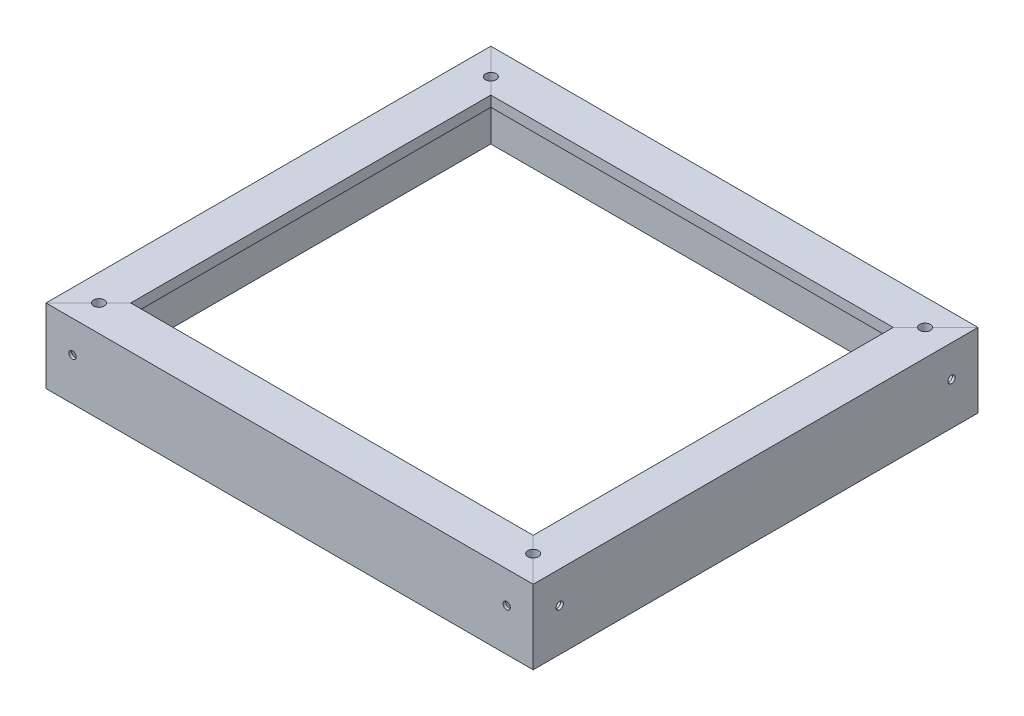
ISO-10303-21;
HEADER;
FILE_DESCRIPTION(('STEP AP214'),'2;1');
FILE_NAME('part.step','',(''),(''),'','','');
FILE_SCHEMA(('AUTOMOTIVE_DESIGN { 1 0 10303 214 1 1 1 1 }'));
ENDSEC;
DATA;
#1=APPLICATION_CONTEXT('core data for automotive mechanical design processes');
#2=APPLICATION_PROTOCOL_DEFINITION('international standard','automotive_design',2000,#1);
#3=PRODUCT_CONTEXT('',#1,'mechanical');
#4=PRODUCT('Part','Part','',(#3));
#5=PRODUCT_RELATED_PRODUCT_CATEGORY('part','',(#4));
#6=PRODUCT_DEFINITION_FORMATION('','',#4);
#7=PRODUCT_DEFINITION_CONTEXT('part definition',#1,'design');
#8=PRODUCT_DEFINITION('design','',#6,#7);
#9=PRODUCT_DEFINITION_SHAPE('','',#8);
#10=(LENGTH_UNIT() NAMED_UNIT(*) SI_UNIT(.MILLI.,.METRE.));
#11=(NAMED_UNIT(*) PLANE_ANGLE_UNIT() SI_UNIT($,.RADIAN.));
#12=(NAMED_UNIT(*) SI_UNIT($,.STERADIAN.) SOLID_ANGLE_UNIT());
#13=UNCERTAINTY_MEASURE_WITH_UNIT(LENGTH_MEASURE(1.E-05),#10,'distance_accuracy_value','');
#14=(GEOMETRIC_REPRESENTATION_CONTEXT(3) GLOBAL_UNCERTAINTY_ASSIGNED_CONTEXT((#13)) GLOBAL_UNIT_ASSIGNED_CONTEXT((#10,
#11,#12)) REPRESENTATION_CONTEXT('',''));
#15=CARTESIAN_POINT('',(0.,0.,0.));
#16=DIRECTION('',(0.,0.,1.));
#17=DIRECTION('',(1.,0.,0.));
#18=AXIS2_PLACEMENT_3D('',#15,#16,#17);
#19=CARTESIAN_POINT('',(73.025,0.,66.675));
#20=DIRECTION('',(0.,0.,-1.));
#21=DIRECTION('',(-1.,0.,0.));
#22=AXIS2_PLACEMENT_3D('',#19,#20,#21);
#23=PLANE('',#22);
#24=CARTESIAN_POINT('',(65.0748,-9.52499999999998,66.675));
#25=DIRECTION('',(0.,0.,-1.));
#26=DIRECTION('',(-1.,0.,0.));
#27=AXIS2_PLACEMENT_3D('',#24,#25,#26);
#28=CIRCLE('',#27,1.09090433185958);
#29=CARTESIAN_POINT('',(63.9838956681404,-9.52499999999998,66.675));
#30=VERTEX_POINT('',#29);
#31=EDGE_CURVE('E344',#30,#30,#28,.F.);
#32=ORIENTED_EDGE('',*,*,#31,.F.);
#33=EDGE_LOOP('',(#32));
#34=FACE_BOUND('',#33,.T.);
#35=CARTESIAN_POINT('',(-65.0748,-9.52499999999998,66.675));
#36=DIRECTION('',(0.,0.,-1.));
#37=DIRECTION('',(-1.,0.,0.));
#38=AXIS2_PLACEMENT_3D('',#35,#36,#37);
#39=CIRCLE('',#38,1.09090433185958);
#40=CARTESIAN_POINT('',(-66.1657043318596,-9.52499999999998,66.675));
#41=VERTEX_POINT('',#40);
#42=EDGE_CURVE('E339',#41,#41,#39,.F.);
#43=ORIENTED_EDGE('',*,*,#42,.F.);
#44=EDGE_LOOP('',(#43));
#45=FACE_BOUND('',#44,.T.);
#46=DIRECTION('',(0.,-1.,0.));
#47=VECTOR('',#46,1.);
#48=CARTESIAN_POINT('',(-73.025,0.,66.675));
#49=LINE('',#48,#47);
#50=CARTESIAN_POINT('',(-73.0249999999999,0.,66.675));
#51=VERTEX_POINT('',#50);
#52=CARTESIAN_POINT('',(-73.0249999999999,-22.225,66.675));
#53=VERTEX_POINT('',#52);
#54=EDGE_CURVE('E291',#51,#53,#49,.T.);
#55=ORIENTED_EDGE('',*,*,#54,.T.);
#56=DIRECTION('',(-1.,0.,0.));
#57=VECTOR('',#56,1.);
#58=CARTESIAN_POINT('',(73.025,-22.225,66.675));
#59=LINE('',#58,#57);
#60=CARTESIAN_POINT('',(73.025,-22.225,66.675));
#61=VERTEX_POINT('',#60);
#62=EDGE_CURVE('E303',#61,#53,#59,.T.);
#63=ORIENTED_EDGE('',*,*,#62,.F.);
#64=DIRECTION('',(0.,-1.,0.));
#65=VECTOR('',#64,1.);
#66=CARTESIAN_POINT('',(73.025,0.,66.675));
#67=LINE('',#66,#65);
#68=CARTESIAN_POINT('',(73.025,0.,66.675));
#69=VERTEX_POINT('',#68);
#70=EDGE_CURVE('E242',#69,#61,#67,.T.);
#71=ORIENTED_EDGE('',*,*,#70,.F.);
#72=DIRECTION('',(-1.,0.,0.));
#73=VECTOR('',#72,1.);
#74=CARTESIAN_POINT('',(73.025,0.,66.675));
#75=LINE('',#74,#73);
#76=EDGE_CURVE('E296',#69,#51,#75,.T.);
#77=ORIENTED_EDGE('',*,*,#76,.T.);
#78=EDGE_LOOP('',(#55,#63,#71,#77));
#79=FACE_BOUND('',#78,.T.);
#80=ADVANCED_FACE('F32',(#34,#45,#79),#23,.F.);
#81=CARTESIAN_POINT('',(73.025,-22.225,63.5));
#82=DIRECTION('',(0.,1.,0.));
#83=DIRECTION('',(0.,0.,1.));
#84=AXIS2_PLACEMENT_3D('',#81,#82,#83);
#85=PLANE('',#84);
#86=DIRECTION('',(-1.,0.,0.));
#87=VECTOR('',#86,1.);
#88=CARTESIAN_POINT('',(73.025,-22.225,63.5));
#89=LINE('',#88,#87);
#90=CARTESIAN_POINT('',(69.85,-22.225,63.5));
#91=VERTEX_POINT('',#90);
#92=CARTESIAN_POINT('',(-69.85,-22.225,63.5));
#93=VERTEX_POINT('',#92);
#94=EDGE_CURVE('E306',#91,#93,#89,.T.);
#95=ORIENTED_EDGE('',*,*,#94,.F.);
#96=DIRECTION('',(0.707106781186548,0.,0.707106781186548));
#97=VECTOR('',#96,1.);
#98=CARTESIAN_POINT('',(4.7625,-22.2249999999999,-1.58749999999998));
#99=LINE('',#98,#97);
#100=EDGE_CURVE('E238',#91,#61,#99,.T.);
#101=ORIENTED_EDGE('',*,*,#100,.T.);
#102=ORIENTED_EDGE('',*,*,#62,.T.);
#103=DIRECTION('',(-0.707106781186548,0.,0.707106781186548));
#104=VECTOR('',#103,1.);
#105=CARTESIAN_POINT('',(-71.4375,-22.225,65.0875));
#106=LINE('',#105,#104);
#107=EDGE_CURVE('E270',#93,#53,#106,.T.);
#108=ORIENTED_EDGE('',*,*,#107,.F.);
#109=EDGE_LOOP('',(#95,#101,#102,#108));
#110=FACE_BOUND('',#109,.T.);
#111=ADVANCED_FACE('F451',(#110),#85,.F.);
#112=CARTESIAN_POINT('',(73.025,-3.17499999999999,63.5));
#113=DIRECTION('',(0.,0.,1.));
#114=DIRECTION('',(1.,0.,0.));
#115=AXIS2_PLACEMENT_3D('',#112,#113,#114);
#116=PLANE('',#115);
#117=CARTESIAN_POINT('',(65.0748,-9.52499999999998,63.5));
#118=DIRECTION('',(0.,0.,1.));
#119=DIRECTION('',(1.,0.,0.));
#120=AXIS2_PLACEMENT_3D('',#117,#118,#119);
#121=CIRCLE('',#120,2.38125);
#122=CARTESIAN_POINT('',(67.45605,-9.52499999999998,63.5));
#123=VERTEX_POINT('',#122);
#124=EDGE_CURVE('E347',#123,#123,#121,.T.);
#125=ORIENTED_EDGE('',*,*,#124,.T.);
#126=EDGE_LOOP('',(#125));
#127=FACE_BOUND('',#126,.T.);
#128=CARTESIAN_POINT('',(-65.0748,-9.52499999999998,63.5));
#129=DIRECTION('',(0.,0.,1.));
#130=DIRECTION('',(1.,0.,0.));
#131=AXIS2_PLACEMENT_3D('',#128,#129,#130);
#132=CIRCLE('',#131,2.38125);
#133=CARTESIAN_POINT('',(-62.69355,-9.52499999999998,63.5));
#134=VERTEX_POINT('',#133);
#135=EDGE_CURVE('E343',#134,#134,#132,.T.);
#136=ORIENTED_EDGE('',*,*,#135,.T.);
#137=EDGE_LOOP('',(#136));
#138=FACE_BOUND('',#137,.T.);
#139=DIRECTION('',(-1.,0.,0.));
#140=VECTOR('',#139,1.);
#141=CARTESIAN_POINT('',(73.025,-3.17499999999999,63.5));
#142=LINE('',#141,#140);
#143=CARTESIAN_POINT('',(69.85,-3.17499999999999,63.5));
#144=VERTEX_POINT('',#143);
#145=CARTESIAN_POINT('',(-69.85,-3.17499999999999,63.5));
#146=VERTEX_POINT('',#145);
#147=EDGE_CURVE('E313',#144,#146,#142,.T.);
#148=ORIENTED_EDGE('',*,*,#147,.F.);
#149=DIRECTION('',(0.,-1.,0.));
#150=VECTOR('',#149,1.);
#151=CARTESIAN_POINT('',(69.85,-3.17499999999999,63.5000000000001));
#152=LINE('',#151,#150);
#153=EDGE_CURVE('E256',#144,#91,#152,.T.);
#154=ORIENTED_EDGE('',*,*,#153,.T.);
#155=ORIENTED_EDGE('',*,*,#94,.T.);
#156=DIRECTION('',(0.,-1.,0.));
#157=VECTOR('',#156,1.);
#158=CARTESIAN_POINT('',(-69.85,-3.17499999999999,63.5));
#159=LINE('',#158,#157);
#160=EDGE_CURVE('E273',#146,#93,#159,.T.);
#161=ORIENTED_EDGE('',*,*,#160,.F.);
#162=EDGE_LOOP('',(#148,#154,#155,#161));
#163=FACE_BOUND('',#162,.T.);
#164=ADVANCED_FACE('F454',(#127,#138,#163),#116,.F.);
#165=CARTESIAN_POINT('',(73.025,-3.17499999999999,63.5));
#166=DIRECTION('',(0.,1.,0.));
#167=DIRECTION('',(0.,0.,1.));
#168=AXIS2_PLACEMENT_3D('',#165,#166,#167);
#169=PLANE('',#168);
#170=DIRECTION('',(0.707106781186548,0.,0.707106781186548));
#171=VECTOR('',#170,1.);
#172=CARTESIAN_POINT('',(4.7625,-3.17499999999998,-1.58749999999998));
#173=LINE('',#172,#171);
#174=CARTESIAN_POINT('',(60.325,-3.17499999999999,53.975));
#175=VERTEX_POINT('',#174);
#176=CARTESIAN_POINT('',(63.9631719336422,-3.17499999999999,57.6131719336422));
#177=VERTEX_POINT('',#176);
#178=EDGE_CURVE('E253',#175,#177,#173,.T.);
#179=ORIENTED_EDGE('',*,*,#178,.T.);
#180=CARTESIAN_POINT('',(65.0875,-3.17499999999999,58.7375));
#181=DIRECTION('',(0.,1.,0.));
#182=DIRECTION('',(-1.,0.,0.));
#183=AXIS2_PLACEMENT_3D('',#180,#181,#182);
#184=CIRCLE('',#183,1.59004);
#185=CARTESIAN_POINT('',(66.2118280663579,-3.17499999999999,59.8618280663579));
#186=VERTEX_POINT('',#185);
#187=EDGE_CURVE('E396',#177,#186,#184,.T.);
#188=ORIENTED_EDGE('',*,*,#187,.T.);
#189=EDGE_CURVE('E252',#186,#144,#173,.T.);
#190=ORIENTED_EDGE('',*,*,#189,.T.);
#191=ORIENTED_EDGE('',*,*,#147,.T.);
#192=DIRECTION('',(-0.707106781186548,0.,0.707106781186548));
#193=VECTOR('',#192,1.);
#194=CARTESIAN_POINT('',(-71.4375,-3.17499999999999,65.0875));
#195=LINE('',#194,#193);
#196=CARTESIAN_POINT('',(-66.2118280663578,-3.17499999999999,59.8618280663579));
#197=VERTEX_POINT('',#196);
#198=EDGE_CURVE('E277',#197,#146,#195,.T.);
#199=ORIENTED_EDGE('',*,*,#198,.F.);
#200=CARTESIAN_POINT('',(-65.0875,-3.17499999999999,58.7375));
#201=DIRECTION('',(0.,1.,0.));
#202=DIRECTION('',(0.,0.,1.));
#203=AXIS2_PLACEMENT_3D('',#200,#201,#202);
#204=CIRCLE('',#203,1.59004);
#205=CARTESIAN_POINT('',(-63.9631719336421,-3.17499999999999,57.6131719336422));
#206=VERTEX_POINT('',#205);
#207=EDGE_CURVE('E307',#197,#206,#204,.T.);
#208=ORIENTED_EDGE('',*,*,#207,.T.);
#209=CARTESIAN_POINT('',(-60.325,-3.17499999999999,53.975));
#210=VERTEX_POINT('',#209);
#211=EDGE_CURVE('E278',#210,#206,#195,.T.);
#212=ORIENTED_EDGE('',*,*,#211,.F.);
#213=DIRECTION('',(-1.,0.,0.));
#214=VECTOR('',#213,1.);
#215=CARTESIAN_POINT('',(73.025,-3.17499999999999,53.975));
#216=LINE('',#215,#214);
#217=EDGE_CURVE('E316',#175,#210,#216,.T.);
#218=ORIENTED_EDGE('',*,*,#217,.F.);
#219=EDGE_LOOP('',(#179,#188,#190,#191,#199,#208,#212,#218));
#220=FACE_BOUND('',#219,.T.);
#221=ADVANCED_FACE('F457',(#220),#169,.F.);
#222=CARTESIAN_POINT('',(73.025,0.,53.975));
#223=DIRECTION('',(0.,0.,1.));
#224=DIRECTION('',(1.,0.,0.));
#225=AXIS2_PLACEMENT_3D('',#222,#223,#224);
#226=PLANE('',#225);
#227=DIRECTION('',(-1.,0.,0.));
#228=VECTOR('',#227,1.);
#229=CARTESIAN_POINT('',(73.025,0.,53.975));
#230=LINE('',#229,#228);
#231=CARTESIAN_POINT('',(60.325,0.,53.975));
#232=VERTEX_POINT('',#231);
#233=CARTESIAN_POINT('',(-60.325,0.,53.975));
#234=VERTEX_POINT('',#233);
#235=EDGE_CURVE('E310',#232,#234,#230,.T.);
#236=ORIENTED_EDGE('',*,*,#235,.F.);
#237=DIRECTION('',(0.,-1.,0.));
#238=VECTOR('',#237,1.);
#239=CARTESIAN_POINT('',(60.325,0.,53.975));
#240=LINE('',#239,#238);
#241=EDGE_CURVE('E248',#232,#175,#240,.T.);
#242=ORIENTED_EDGE('',*,*,#241,.T.);
#243=ORIENTED_EDGE('',*,*,#217,.T.);
#244=DIRECTION('',(0.,-1.,0.));
#245=VECTOR('',#244,1.);
#246=CARTESIAN_POINT('',(-60.325,0.,53.975));
#247=LINE('',#246,#245);
#248=EDGE_CURVE('E281',#234,#210,#247,.T.);
#249=ORIENTED_EDGE('',*,*,#248,.F.);
#250=EDGE_LOOP('',(#236,#242,#243,#249));
#251=FACE_BOUND('',#250,.T.);
#252=ADVANCED_FACE('F466',(#251),#226,.F.);
#253=CARTESIAN_POINT('',(73.025,0.,66.675));
#254=DIRECTION('',(0.,-1.,0.));
#255=DIRECTION('',(0.,0.,-1.));
#256=AXIS2_PLACEMENT_3D('',#253,#254,#255);
#257=PLANE('',#256);
#258=DIRECTION('',(-0.707106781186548,0.,-0.707106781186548));
#259=VECTOR('',#258,1.);
#260=CARTESIAN_POINT('',(6.35000000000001,0.,0.));
#261=LINE('',#260,#259);
#262=CARTESIAN_POINT('',(66.2118280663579,0.,59.8618280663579));
#263=VERTEX_POINT('',#262);
#264=EDGE_CURVE('E245',#69,#263,#261,.T.);
#265=ORIENTED_EDGE('',*,*,#264,.T.);
#266=CARTESIAN_POINT('',(65.0875,0.,58.7375));
#267=DIRECTION('',(0.,1.,0.));
#268=DIRECTION('',(0.,0.,1.));
#269=AXIS2_PLACEMENT_3D('',#266,#267,#268);
#270=CIRCLE('',#269,1.59004);
#271=CARTESIAN_POINT('',(63.9631719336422,0.,57.6131719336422));
#272=VERTEX_POINT('',#271);
#273=EDGE_CURVE('E391',#272,#263,#270,.T.);
#274=ORIENTED_EDGE('',*,*,#273,.F.);
#275=EDGE_CURVE('E249',#272,#232,#261,.T.);
#276=ORIENTED_EDGE('',*,*,#275,.T.);
#277=ORIENTED_EDGE('',*,*,#235,.T.);
#278=DIRECTION('',(0.707106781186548,0.,-0.707106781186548));
#279=VECTOR('',#278,1.);
#280=CARTESIAN_POINT('',(-73.025,0.,66.675));
#281=LINE('',#280,#279);
#282=CARTESIAN_POINT('',(-63.9631719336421,0.,57.6131719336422));
#283=VERTEX_POINT('',#282);
#284=EDGE_CURVE('E284',#283,#234,#281,.T.);
#285=ORIENTED_EDGE('',*,*,#284,.F.);
#286=CARTESIAN_POINT('',(-65.0875,0.,58.7375));
#287=DIRECTION('',(0.,1.,0.));
#288=DIRECTION('',(0.,0.,1.));
#289=AXIS2_PLACEMENT_3D('',#286,#287,#288);
#290=CIRCLE('',#289,1.59004);
#291=CARTESIAN_POINT('',(-66.2118280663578,0.,59.8618280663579));
#292=VERTEX_POINT('',#291);
#293=EDGE_CURVE('E400',#292,#283,#290,.T.);
#294=ORIENTED_EDGE('',*,*,#293,.F.);
#295=EDGE_CURVE('E285',#51,#292,#281,.T.);
#296=ORIENTED_EDGE('',*,*,#295,.F.);
#297=ORIENTED_EDGE('',*,*,#76,.F.);
#298=EDGE_LOOP('',(#265,#274,#276,#277,#285,#294,#296,#297));
#299=FACE_BOUND('',#298,.T.);
#300=ADVANCED_FACE('F34',(#299),#257,.F.);
#301=CARTESIAN_POINT('',(-73.025,0.,0.));
#302=DIRECTION('',(1.,0.,0.));
#303=DIRECTION('',(0.,0.,-1.));
#304=AXIS2_PLACEMENT_3D('',#301,#302,#303);
#305=PLANE('',#304);
#306=CARTESIAN_POINT('',(-73.025,-9.52499999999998,-58.7248));
#307=DIRECTION('',(1.,0.,0.));
#308=DIRECTION('',(0.,0.,-1.));
#309=AXIS2_PLACEMENT_3D('',#306,#307,#308);
#310=CIRCLE('',#309,1.09090433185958);
#311=CARTESIAN_POINT('',(-73.025,-9.52499999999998,-59.8157043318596));
#312=VERTEX_POINT('',#311);
#313=EDGE_CURVE('E324',#312,#312,#310,.F.);
#314=ORIENTED_EDGE('',*,*,#313,.F.);
#315=EDGE_LOOP('',(#314));
#316=FACE_BOUND('',#315,.T.);
#317=CARTESIAN_POINT('',(-73.025,-9.52499999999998,58.7248));
#318=DIRECTION('',(1.,0.,0.));
#319=DIRECTION('',(0.,0.,-1.));
#320=AXIS2_PLACEMENT_3D('',#317,#318,#319);
#321=CIRCLE('',#320,1.09090433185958);
#322=CARTESIAN_POINT('',(-73.025,-9.52499999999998,57.6338956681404));
#323=VERTEX_POINT('',#322);
#324=EDGE_CURVE('E183',#323,#323,#321,.F.);
#325=ORIENTED_EDGE('',*,*,#324,.F.);
#326=EDGE_LOOP('',(#325));
#327=FACE_BOUND('',#326,.T.);
#328=DIRECTION('',(0.,0.,-1.));
#329=VECTOR('',#328,1.);
#330=CARTESIAN_POINT('',(-73.025,0.,0.));
#331=LINE('',#330,#329);
#332=CARTESIAN_POINT('',(-73.025,0.,-66.675));
#333=VERTEX_POINT('',#332);
#334=EDGE_CURVE('E274',#51,#333,#331,.T.);
#335=ORIENTED_EDGE('',*,*,#334,.T.);
#336=DIRECTION('',(0.,-1.,0.));
#337=VECTOR('',#336,1.);
#338=CARTESIAN_POINT('',(-73.025,0.,-66.675));
#339=LINE('',#338,#337);
#340=CARTESIAN_POINT('',(-73.025,-22.225,-66.675));
#341=VERTEX_POINT('',#340);
#342=EDGE_CURVE('E200',#333,#341,#339,.T.);
#343=ORIENTED_EDGE('',*,*,#342,.T.);
#344=DIRECTION('',(0.,0.,-1.));
#345=VECTOR('',#344,1.);
#346=CARTESIAN_POINT('',(-73.025,-22.225,0.));
#347=LINE('',#346,#345);
#348=EDGE_CURVE('E288',#53,#341,#347,.T.);
#349=ORIENTED_EDGE('',*,*,#348,.F.);
#350=ORIENTED_EDGE('',*,*,#54,.F.);
#351=EDGE_LOOP('',(#335,#343,#349,#350));
#352=FACE_BOUND('',#351,.T.);
#353=ADVANCED_FACE('F517',(#316,#327,#352),#305,.F.);
#354=CARTESIAN_POINT('',(-69.85,-22.225,0.));
#355=DIRECTION('',(0.,1.,0.));
#356=DIRECTION('',(-1.,0.,0.));
#357=AXIS2_PLACEMENT_3D('',#354,#355,#356);
#358=PLANE('',#357);
#359=ORIENTED_EDGE('',*,*,#348,.T.);
#360=DIRECTION('',(-0.707106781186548,0.,-0.707106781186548));
#361=VECTOR('',#360,1.);
#362=CARTESIAN_POINT('',(-71.4375,-22.225,-65.0875));
#363=LINE('',#362,#361);
#364=CARTESIAN_POINT('',(-69.85,-22.225,-63.5));
#365=VERTEX_POINT('',#364);
#366=EDGE_CURVE('E207',#365,#341,#363,.T.);
#367=ORIENTED_EDGE('',*,*,#366,.F.);
#368=DIRECTION('',(0.,0.,-1.));
#369=VECTOR('',#368,1.);
#370=CARTESIAN_POINT('',(-69.85,-22.225,0.));
#371=LINE('',#370,#369);
#372=EDGE_CURVE('E290',#93,#365,#371,.T.);
#373=ORIENTED_EDGE('',*,*,#372,.F.);
#374=ORIENTED_EDGE('',*,*,#107,.T.);
#375=EDGE_LOOP('',(#359,#367,#373,#374));
#376=FACE_BOUND('',#375,.T.);
#377=ADVANCED_FACE('F440',(#376),#358,.F.);
#378=CARTESIAN_POINT('',(-69.85,-3.17499999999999,0.));
#379=DIRECTION('',(-1.,0.,0.));
#380=DIRECTION('',(0.,0.,1.));
#381=AXIS2_PLACEMENT_3D('',#378,#379,#380);
#382=PLANE('',#381);
#383=CARTESIAN_POINT('',(-69.8500000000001,-9.52499999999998,-58.7248));
#384=DIRECTION('',(-1.,0.,0.));
#385=DIRECTION('',(0.,0.,1.));
#386=AXIS2_PLACEMENT_3D('',#383,#384,#385);
#387=CIRCLE('',#386,2.38125);
#388=CARTESIAN_POINT('',(-69.8500000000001,-9.52499999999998,-56.34355));
#389=VERTEX_POINT('',#388);
#390=EDGE_CURVE('E328',#389,#389,#387,.T.);
#391=ORIENTED_EDGE('',*,*,#390,.T.);
#392=EDGE_LOOP('',(#391));
#393=FACE_BOUND('',#392,.T.);
#394=CARTESIAN_POINT('',(-69.85,-9.52499999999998,58.7248));
#395=DIRECTION('',(-1.,0.,0.));
#396=DIRECTION('',(0.,0.,1.));
#397=AXIS2_PLACEMENT_3D('',#394,#395,#396);
#398=CIRCLE('',#397,2.38125);
#399=CARTESIAN_POINT('',(-69.85,-9.52499999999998,61.10605));
#400=VERTEX_POINT('',#399);
#401=EDGE_CURVE('E323',#400,#400,#398,.T.);
#402=ORIENTED_EDGE('',*,*,#401,.T.);
#403=EDGE_LOOP('',(#402));
#404=FACE_BOUND('',#403,.T.);
#405=ORIENTED_EDGE('',*,*,#372,.T.);
#406=DIRECTION('',(0.,-1.,0.));
#407=VECTOR('',#406,1.);
#408=CARTESIAN_POINT('',(-69.85,-3.17499999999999,-63.5));
#409=LINE('',#408,#407);
#410=CARTESIAN_POINT('',(-69.85,-3.17499999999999,-63.5));
#411=VERTEX_POINT('',#410);
#412=EDGE_CURVE('E220',#411,#365,#409,.T.);
#413=ORIENTED_EDGE('',*,*,#412,.F.);
#414=DIRECTION('',(0.,0.,-1.));
#415=VECTOR('',#414,1.);
#416=CARTESIAN_POINT('',(-69.85,-3.17499999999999,0.));
#417=LINE('',#416,#415);
#418=EDGE_CURVE('E298',#146,#411,#417,.T.);
#419=ORIENTED_EDGE('',*,*,#418,.F.);
#420=ORIENTED_EDGE('',*,*,#160,.T.);
#421=EDGE_LOOP('',(#405,#413,#419,#420));
#422=FACE_BOUND('',#421,.T.);
#423=ADVANCED_FACE('F436',(#393,#404,#422),#382,.F.);
#424=CARTESIAN_POINT('',(-69.85,-3.17499999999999,0.));
#425=DIRECTION('',(0.,1.,0.));
#426=DIRECTION('',(-1.,0.,0.));
#427=AXIS2_PLACEMENT_3D('',#424,#425,#426);
#428=PLANE('',#427);
#429=ORIENTED_EDGE('',*,*,#418,.T.);
#430=DIRECTION('',(-0.707106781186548,0.,-0.707106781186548));
#431=VECTOR('',#430,1.);
#432=CARTESIAN_POINT('',(-71.4375,-3.17499999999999,-65.0875));
#433=LINE('',#432,#431);
#434=CARTESIAN_POINT('',(-66.2118280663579,-3.17499999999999,-59.8618280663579));
#435=VERTEX_POINT('',#434);
#436=EDGE_CURVE('E216',#435,#411,#433,.T.);
#437=ORIENTED_EDGE('',*,*,#436,.F.);
#438=CARTESIAN_POINT('',(-65.0875,-3.17499999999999,-58.7375));
#439=DIRECTION('',(0.,1.,0.));
#440=DIRECTION('',(-1.,0.,0.));
#441=AXIS2_PLACEMENT_3D('',#438,#439,#440);
#442=CIRCLE('',#441,1.59004);
#443=CARTESIAN_POINT('',(-63.9631719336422,-3.17499999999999,-57.6131719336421));
#444=VERTEX_POINT('',#443);
#445=EDGE_CURVE('E55',#435,#444,#442,.T.);
#446=ORIENTED_EDGE('',*,*,#445,.T.);
#447=CARTESIAN_POINT('',(-60.325,-3.17499999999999,-53.975));
#448=VERTEX_POINT('',#447);
#449=EDGE_CURVE('E217',#448,#444,#433,.T.);
#450=ORIENTED_EDGE('',*,*,#449,.F.);
#451=DIRECTION('',(0.,0.,-1.));
#452=VECTOR('',#451,1.);
#453=CARTESIAN_POINT('',(-60.325,-3.17499999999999,0.));
#454=LINE('',#453,#452);
#455=EDGE_CURVE('E300',#210,#448,#454,.T.);
#456=ORIENTED_EDGE('',*,*,#455,.F.);
#457=ORIENTED_EDGE('',*,*,#211,.T.);
#458=CARTESIAN_POINT('',(-65.0875,-3.17499999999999,58.7375));
#459=DIRECTION('',(0.,1.,0.));
#460=DIRECTION('',(-1.,0.,0.));
#461=AXIS2_PLACEMENT_3D('',#458,#459,#460);
#462=CIRCLE('',#461,1.59004);
#463=EDGE_CURVE('E403',#206,#197,#462,.T.);
#464=ORIENTED_EDGE('',*,*,#463,.T.);
#465=ORIENTED_EDGE('',*,*,#198,.T.);
#466=EDGE_LOOP('',(#429,#437,#446,#450,#456,#457,#464,#465));
#467=FACE_BOUND('',#466,.T.);
#468=ADVANCED_FACE('F525',(#467),#428,.F.);
#469=CARTESIAN_POINT('',(-60.325,0.,0.));
#470=DIRECTION('',(-1.,0.,0.));
#471=DIRECTION('',(0.,0.,1.));
#472=AXIS2_PLACEMENT_3D('',#469,#470,#471);
#473=PLANE('',#472);
#474=ORIENTED_EDGE('',*,*,#455,.T.);
#475=DIRECTION('',(0.,-1.,0.));
#476=VECTOR('',#475,1.);
#477=CARTESIAN_POINT('',(-60.325,0.,-53.975));
#478=LINE('',#477,#476);
#479=CARTESIAN_POINT('',(-60.325,0.,-53.975));
#480=VERTEX_POINT('',#479);
#481=EDGE_CURVE('E212',#480,#448,#478,.T.);
#482=ORIENTED_EDGE('',*,*,#481,.F.);
#483=DIRECTION('',(0.,0.,-1.));
#484=VECTOR('',#483,1.);
#485=CARTESIAN_POINT('',(-60.325,0.,0.));
#486=LINE('',#485,#484);
#487=EDGE_CURVE('E293',#234,#480,#486,.T.);
#488=ORIENTED_EDGE('',*,*,#487,.F.);
#489=ORIENTED_EDGE('',*,*,#248,.T.);
#490=EDGE_LOOP('',(#474,#482,#488,#489));
#491=FACE_BOUND('',#490,.T.);
#492=ADVANCED_FACE('F529',(#491),#473,.F.);
#493=CARTESIAN_POINT('',(-73.025,0.,0.));
#494=DIRECTION('',(0.,-1.,0.));
#495=DIRECTION('',(0.,0.,-1.));
#496=AXIS2_PLACEMENT_3D('',#493,#494,#495);
#497=PLANE('',#496);
#498=ORIENTED_EDGE('',*,*,#487,.T.);
#499=DIRECTION('',(0.707106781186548,0.,0.707106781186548));
#500=VECTOR('',#499,1.);
#501=CARTESIAN_POINT('',(-73.025,0.,-66.675));
#502=LINE('',#501,#500);
#503=CARTESIAN_POINT('',(-63.9631719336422,0.,-57.6131719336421));
#504=VERTEX_POINT('',#503);
#505=EDGE_CURVE('E213',#504,#480,#502,.T.);
#506=ORIENTED_EDGE('',*,*,#505,.F.);
#507=CARTESIAN_POINT('',(-65.0875,0.,-58.7375));
#508=DIRECTION('',(0.,1.,0.));
#509=DIRECTION('',(0.,0.,1.));
#510=AXIS2_PLACEMENT_3D('',#507,#508,#509);
#511=CIRCLE('',#510,1.59004);
#512=CARTESIAN_POINT('',(-66.2118280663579,0.,-59.8618280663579));
#513=VERTEX_POINT('',#512);
#514=EDGE_CURVE('E389',#513,#504,#511,.T.);
#515=ORIENTED_EDGE('',*,*,#514,.F.);
#516=EDGE_CURVE('E210',#333,#513,#502,.T.);
#517=ORIENTED_EDGE('',*,*,#516,.F.);
#518=ORIENTED_EDGE('',*,*,#334,.F.);
#519=ORIENTED_EDGE('',*,*,#295,.T.);
#520=EDGE_CURVE('E401',#283,#292,#290,.T.);
#521=ORIENTED_EDGE('',*,*,#520,.F.);
#522=ORIENTED_EDGE('',*,*,#284,.T.);
#523=EDGE_LOOP('',(#498,#506,#515,#517,#518,#519,#521,#522));
#524=FACE_BOUND('',#523,.T.);
#525=ADVANCED_FACE('F503',(#524),#497,.F.);
#526=CARTESIAN_POINT('',(73.025,0.,-66.675));
#527=DIRECTION('',(-1.,0.,0.));
#528=DIRECTION('',(0.,0.,1.));
#529=AXIS2_PLACEMENT_3D('',#526,#527,#528);
#530=PLANE('',#529);
#531=CARTESIAN_POINT('',(73.025,-9.52499999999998,-58.7248));
#532=DIRECTION('',(-1.,0.,0.));
#533=DIRECTION('',(0.,0.,1.));
#534=AXIS2_PLACEMENT_3D('',#531,#532,#533);
#535=CIRCLE('',#534,1.09090433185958);
#536=CARTESIAN_POINT('',(73.025,-9.52499999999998,-57.6338956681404));
#537=VERTEX_POINT('',#536);
#538=EDGE_CURVE('E334',#537,#537,#535,.F.);
#539=ORIENTED_EDGE('',*,*,#538,.F.);
#540=EDGE_LOOP('',(#539));
#541=FACE_BOUND('',#540,.T.);
#542=CARTESIAN_POINT('',(73.025,-9.52499999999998,58.7248));
#543=DIRECTION('',(-1.,0.,0.));
#544=DIRECTION('',(0.,0.,1.));
#545=AXIS2_PLACEMENT_3D('',#542,#543,#544);
#546=CIRCLE('',#545,1.09090433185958);
#547=CARTESIAN_POINT('',(73.025,-9.52499999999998,59.8157043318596));
#548=VERTEX_POINT('',#547);
#549=EDGE_CURVE('E329',#548,#548,#546,.F.);
#550=ORIENTED_EDGE('',*,*,#549,.F.);
#551=EDGE_LOOP('',(#550));
#552=FACE_BOUND('',#551,.T.);
#553=ORIENTED_EDGE('',*,*,#70,.T.);
#554=DIRECTION('',(0.,0.,1.));
#555=VECTOR('',#554,1.);
#556=CARTESIAN_POINT('',(73.025,-22.225,-66.675));
#557=LINE('',#556,#555);
#558=CARTESIAN_POINT('',(73.025,-22.225,-66.675));
#559=VERTEX_POINT('',#558);
#560=EDGE_CURVE('E234',#559,#61,#557,.T.);
#561=ORIENTED_EDGE('',*,*,#560,.F.);
#562=DIRECTION('',(0.,-1.,0.));
#563=VECTOR('',#562,1.);
#564=CARTESIAN_POINT('',(73.025,0.,-66.675));
#565=LINE('',#564,#563);
#566=CARTESIAN_POINT('',(73.025,0.,-66.675));
#567=VERTEX_POINT('',#566);
#568=EDGE_CURVE('E204',#567,#559,#565,.T.);
#569=ORIENTED_EDGE('',*,*,#568,.F.);
#570=DIRECTION('',(0.,0.,1.));
#571=VECTOR('',#570,1.);
#572=CARTESIAN_POINT('',(73.025,0.,-66.675));
#573=LINE('',#572,#571);
#574=EDGE_CURVE('E239',#567,#69,#573,.T.);
#575=ORIENTED_EDGE('',*,*,#574,.T.);
#576=EDGE_LOOP('',(#553,#561,#569,#575));
#577=FACE_BOUND('',#576,.T.);
#578=ADVANCED_FACE('F500',(#541,#552,#577),#530,.F.);
#579=CARTESIAN_POINT('',(69.85,-22.225,-66.675));
#580=DIRECTION('',(0.,1.,0.));
#581=DIRECTION('',(-1.,0.,0.));
#582=AXIS2_PLACEMENT_3D('',#579,#580,#581);
#583=PLANE('',#582);
#584=DIRECTION('',(0.,0.,1.));
#585=VECTOR('',#584,1.);
#586=CARTESIAN_POINT('',(69.85,-22.225,-66.675));
#587=LINE('',#586,#585);
#588=CARTESIAN_POINT('',(69.85,-22.225,-63.5));
#589=VERTEX_POINT('',#588);
#590=EDGE_CURVE('E237',#589,#91,#587,.T.);
#591=ORIENTED_EDGE('',*,*,#590,.F.);
#592=DIRECTION('',(0.707106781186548,0.,-0.707106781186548));
#593=VECTOR('',#592,1.);
#594=CARTESIAN_POINT('',(-1.58750000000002,-22.2249999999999,7.93750000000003));
#595=LINE('',#594,#593);
#596=EDGE_CURVE('E209',#589,#559,#595,.T.);
#597=ORIENTED_EDGE('',*,*,#596,.T.);
#598=ORIENTED_EDGE('',*,*,#560,.T.);
#599=ORIENTED_EDGE('',*,*,#100,.F.);
#600=EDGE_LOOP('',(#591,#597,#598,#599));
#601=FACE_BOUND('',#600,.T.);
#602=ADVANCED_FACE('F446',(#601),#583,.F.);
#603=CARTESIAN_POINT('',(69.85,-3.17499999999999,-66.675));
#604=DIRECTION('',(1.,0.,0.));
#605=DIRECTION('',(0.,0.,-1.));
#606=AXIS2_PLACEMENT_3D('',#603,#604,#605);
#607=PLANE('',#606);
#608=CARTESIAN_POINT('',(69.8500000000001,-9.52499999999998,-58.7248));
#609=DIRECTION('',(-1.,0.,0.));
#610=DIRECTION('',(0.,0.,1.));
#611=AXIS2_PLACEMENT_3D('',#608,#609,#610);
#612=CIRCLE('',#611,2.38125);
#613=CARTESIAN_POINT('',(69.8500000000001,-9.52499999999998,-56.34355));
#614=VERTEX_POINT('',#613);
#615=EDGE_CURVE('E338',#614,#614,#612,.T.);
#616=ORIENTED_EDGE('',*,*,#615,.F.);
#617=EDGE_LOOP('',(#616));
#618=FACE_BOUND('',#617,.T.);
#619=CARTESIAN_POINT('',(69.85,-9.52499999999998,58.7248));
#620=DIRECTION('',(-1.,0.,0.));
#621=DIRECTION('',(0.,0.,1.));
#622=AXIS2_PLACEMENT_3D('',#619,#620,#621);
#623=CIRCLE('',#622,2.38125);
#624=CARTESIAN_POINT('',(69.85,-9.52499999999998,61.10605));
#625=VERTEX_POINT('',#624);
#626=EDGE_CURVE('E333',#625,#625,#623,.T.);
#627=ORIENTED_EDGE('',*,*,#626,.F.);
#628=EDGE_LOOP('',(#627));
#629=FACE_BOUND('',#628,.T.);
#630=DIRECTION('',(0.,0.,1.));
#631=VECTOR('',#630,1.);
#632=CARTESIAN_POINT('',(69.85,-3.17499999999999,-66.675));
#633=LINE('',#632,#631);
#634=CARTESIAN_POINT('',(69.85,-3.17499999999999,-63.5));
#635=VERTEX_POINT('',#634);
#636=EDGE_CURVE('E263',#635,#144,#633,.T.);
#637=ORIENTED_EDGE('',*,*,#636,.F.);
#638=DIRECTION('',(0.,-1.,0.));
#639=VECTOR('',#638,1.);
#640=CARTESIAN_POINT('',(69.85,-3.17499999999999,-63.5));
#641=LINE('',#640,#639);
#642=EDGE_CURVE('E410',#635,#589,#641,.T.);
#643=ORIENTED_EDGE('',*,*,#642,.T.);
#644=ORIENTED_EDGE('',*,*,#590,.T.);
#645=ORIENTED_EDGE('',*,*,#153,.F.);
#646=EDGE_LOOP('',(#637,#643,#644,#645));
#647=FACE_BOUND('',#646,.T.);
#648=ADVANCED_FACE('F428',(#618,#629,#647),#607,.F.);
#649=CARTESIAN_POINT('',(69.85,-3.17499999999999,-66.675));
#650=DIRECTION('',(0.,1.,0.));
#651=DIRECTION('',(-1.,0.,0.));
#652=AXIS2_PLACEMENT_3D('',#649,#650,#651);
#653=PLANE('',#652);
#654=DIRECTION('',(0.707106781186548,0.,-0.707106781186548));
#655=VECTOR('',#654,1.);
#656=CARTESIAN_POINT('',(-1.58750000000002,-3.17499999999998,7.93750000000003));
#657=LINE('',#656,#655);
#658=CARTESIAN_POINT('',(60.325,-3.17499999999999,-53.975));
#659=VERTEX_POINT('',#658);
#660=CARTESIAN_POINT('',(63.9631719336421,-3.17499999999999,-57.6131719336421));
#661=VERTEX_POINT('',#660);
#662=EDGE_CURVE('E192',#659,#661,#657,.T.);
#663=ORIENTED_EDGE('',*,*,#662,.T.);
#664=CARTESIAN_POINT('',(65.0874999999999,-3.17499999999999,-58.7375));
#665=DIRECTION('',(0.,1.,0.));
#666=DIRECTION('',(-1.,0.,0.));
#667=AXIS2_PLACEMENT_3D('',#664,#665,#666);
#668=CIRCLE('',#667,1.59004);
#669=CARTESIAN_POINT('',(66.2118280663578,-3.17499999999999,-59.8618280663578));
#670=VERTEX_POINT('',#669);
#671=EDGE_CURVE('E48',#661,#670,#668,.T.);
#672=ORIENTED_EDGE('',*,*,#671,.T.);
#673=EDGE_CURVE('E412',#670,#635,#657,.T.);
#674=ORIENTED_EDGE('',*,*,#673,.T.);
#675=ORIENTED_EDGE('',*,*,#636,.T.);
#676=ORIENTED_EDGE('',*,*,#189,.F.);
#677=EDGE_CURVE('E397',#186,#177,#184,.T.);
#678=ORIENTED_EDGE('',*,*,#677,.T.);
#679=ORIENTED_EDGE('',*,*,#178,.F.);
#680=DIRECTION('',(0.,0.,1.));
#681=VECTOR('',#680,1.);
#682=CARTESIAN_POINT('',(60.325,-3.17499999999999,-66.675));
#683=LINE('',#682,#681);
#684=EDGE_CURVE('E266',#659,#175,#683,.T.);
#685=ORIENTED_EDGE('',*,*,#684,.F.);
#686=EDGE_LOOP('',(#663,#672,#674,#675,#676,#678,#679,#685));
#687=FACE_BOUND('',#686,.T.);
#688=ADVANCED_FACE('F418',(#687),#653,.F.);
#689=CARTESIAN_POINT('',(60.325,0.,-66.675));
#690=DIRECTION('',(1.,0.,0.));
#691=DIRECTION('',(0.,0.,-1.));
#692=AXIS2_PLACEMENT_3D('',#689,#690,#691);
#693=PLANE('',#692);
#694=DIRECTION('',(0.,0.,1.));
#695=VECTOR('',#694,1.);
#696=CARTESIAN_POINT('',(60.325,0.,-66.675));
#697=LINE('',#696,#695);
#698=CARTESIAN_POINT('',(60.325,0.,-53.975));
#699=VERTEX_POINT('',#698);
#700=EDGE_CURVE('E243',#699,#232,#697,.T.);
#701=ORIENTED_EDGE('',*,*,#700,.F.);
#702=DIRECTION('',(0.,-1.,0.));
#703=VECTOR('',#702,1.);
#704=CARTESIAN_POINT('',(60.325,0.,-53.975));
#705=LINE('',#704,#703);
#706=EDGE_CURVE('E190',#699,#659,#705,.T.);
#707=ORIENTED_EDGE('',*,*,#706,.T.);
#708=ORIENTED_EDGE('',*,*,#684,.T.);
#709=ORIENTED_EDGE('',*,*,#241,.F.);
#710=EDGE_LOOP('',(#701,#707,#708,#709));
#711=FACE_BOUND('',#710,.T.);
#712=ADVANCED_FACE('F469',(#711),#693,.F.);
#713=CARTESIAN_POINT('',(73.025,0.,-66.675));
#714=DIRECTION('',(0.,-1.,0.));
#715=DIRECTION('',(0.,0.,-1.));
#716=AXIS2_PLACEMENT_3D('',#713,#714,#715);
#717=PLANE('',#716);
#718=DIRECTION('',(-0.707106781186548,0.,0.707106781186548));
#719=VECTOR('',#718,1.);
#720=CARTESIAN_POINT('',(0.,0.,6.35000000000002));
#721=LINE('',#720,#719);
#722=CARTESIAN_POINT('',(66.2118280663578,0.,-59.8618280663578));
#723=VERTEX_POINT('',#722);
#724=EDGE_CURVE('E11',#567,#723,#721,.T.);
#725=ORIENTED_EDGE('',*,*,#724,.T.);
#726=CARTESIAN_POINT('',(65.0874999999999,0.,-58.7375));
#727=DIRECTION('',(0.,1.,0.));
#728=DIRECTION('',(0.,0.,1.));
#729=AXIS2_PLACEMENT_3D('',#726,#727,#728);
#730=CIRCLE('',#729,1.59004);
#731=CARTESIAN_POINT('',(63.9631719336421,0.,-57.6131719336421));
#732=VERTEX_POINT('',#731);
#733=EDGE_CURVE('E173',#732,#723,#730,.T.);
#734=ORIENTED_EDGE('',*,*,#733,.F.);
#735=EDGE_CURVE('E41',#732,#699,#721,.T.);
#736=ORIENTED_EDGE('',*,*,#735,.T.);
#737=ORIENTED_EDGE('',*,*,#700,.T.);
#738=ORIENTED_EDGE('',*,*,#275,.F.);
#739=EDGE_CURVE('E394',#263,#272,#270,.T.);
#740=ORIENTED_EDGE('',*,*,#739,.F.);
#741=ORIENTED_EDGE('',*,*,#264,.F.);
#742=ORIENTED_EDGE('',*,*,#574,.F.);
#743=EDGE_LOOP('',(#725,#734,#736,#737,#738,#740,#741,#742));
#744=FACE_BOUND('',#743,.T.);
#745=ADVANCED_FACE('F179',(#744),#717,.F.);
#746=CARTESIAN_POINT('',(-73.025,0.,-66.675));
#747=DIRECTION('',(0.,0.,1.));
#748=DIRECTION('',(1.,0.,0.));
#749=AXIS2_PLACEMENT_3D('',#746,#747,#748);
#750=PLANE('',#749);
#751=CARTESIAN_POINT('',(65.0748,-9.52499999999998,-66.675));
#752=DIRECTION('',(0.,0.,1.));
#753=DIRECTION('',(1.,0.,0.));
#754=AXIS2_PLACEMENT_3D('',#751,#752,#753);
#755=CIRCLE('',#754,1.09090433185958);
#756=CARTESIAN_POINT('',(66.1657043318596,-9.52499999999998,-66.675));
#757=VERTEX_POINT('',#756);
#758=EDGE_CURVE('E36',#757,#757,#755,.F.);
#759=ORIENTED_EDGE('',*,*,#758,.F.);
#760=EDGE_LOOP('',(#759));
#761=FACE_BOUND('',#760,.T.);
#762=CARTESIAN_POINT('',(-65.0748,-9.52499999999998,-66.675));
#763=DIRECTION('',(0.,0.,1.));
#764=DIRECTION('',(1.,0.,0.));
#765=AXIS2_PLACEMENT_3D('',#762,#763,#764);
#766=CIRCLE('',#765,1.09090433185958);
#767=CARTESIAN_POINT('',(-63.9838956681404,-9.52499999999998,-66.675));
#768=VERTEX_POINT('',#767);
#769=EDGE_CURVE('E348',#768,#768,#766,.F.);
#770=ORIENTED_EDGE('',*,*,#769,.F.);
#771=EDGE_LOOP('',(#770));
#772=FACE_BOUND('',#771,.T.);
#773=ORIENTED_EDGE('',*,*,#568,.T.);
#774=DIRECTION('',(1.,0.,0.));
#775=VECTOR('',#774,1.);
#776=CARTESIAN_POINT('',(-73.025,-22.225,-66.675));
#777=LINE('',#776,#775);
#778=EDGE_CURVE('E196',#341,#559,#777,.T.);
#779=ORIENTED_EDGE('',*,*,#778,.F.);
#780=ORIENTED_EDGE('',*,*,#342,.F.);
#781=DIRECTION('',(1.,0.,0.));
#782=VECTOR('',#781,1.);
#783=CARTESIAN_POINT('',(-73.025,0.,-66.675));
#784=LINE('',#783,#782);
#785=EDGE_CURVE('E201',#333,#567,#784,.T.);
#786=ORIENTED_EDGE('',*,*,#785,.T.);
#787=EDGE_LOOP('',(#773,#779,#780,#786));
#788=FACE_BOUND('',#787,.T.);
#789=ADVANCED_FACE('F516',(#761,#772,#788),#750,.F.);
#790=CARTESIAN_POINT('',(-73.025,-22.225,-63.5));
#791=DIRECTION('',(0.,1.,0.));
#792=DIRECTION('',(0.,0.,1.));
#793=AXIS2_PLACEMENT_3D('',#790,#791,#792);
#794=PLANE('',#793);
#795=ORIENTED_EDGE('',*,*,#366,.T.);
#796=ORIENTED_EDGE('',*,*,#778,.T.);
#797=ORIENTED_EDGE('',*,*,#596,.F.);
#798=DIRECTION('',(1.,0.,0.));
#799=VECTOR('',#798,1.);
#800=CARTESIAN_POINT('',(-73.025,-22.225,-63.5));
#801=LINE('',#800,#799);
#802=EDGE_CURVE('E199',#365,#589,#801,.T.);
#803=ORIENTED_EDGE('',*,*,#802,.F.);
#804=EDGE_LOOP('',(#795,#796,#797,#803));
#805=FACE_BOUND('',#804,.T.);
#806=ADVANCED_FACE('F442',(#805),#794,.F.);
#807=CARTESIAN_POINT('',(-73.025,-3.17499999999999,-63.5));
#808=DIRECTION('',(0.,0.,-1.));
#809=DIRECTION('',(-1.,0.,0.));
#810=AXIS2_PLACEMENT_3D('',#807,#808,#809);
#811=PLANE('',#810);
#812=CARTESIAN_POINT('',(65.0748,-9.52499999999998,-63.5));
#813=DIRECTION('',(0.,0.,1.));
#814=DIRECTION('',(1.,0.,0.));
#815=AXIS2_PLACEMENT_3D('',#812,#813,#814);
#816=CIRCLE('',#815,2.38125);
#817=CARTESIAN_POINT('',(67.45605,-9.52499999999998,-63.5));
#818=VERTEX_POINT('',#817);
#819=EDGE_CURVE('E950',#818,#818,#816,.T.);
#820=ORIENTED_EDGE('',*,*,#819,.F.);
#821=EDGE_LOOP('',(#820));
#822=FACE_BOUND('',#821,.T.);
#823=CARTESIAN_POINT('',(-65.0748,-9.52499999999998,-63.5));
#824=DIRECTION('',(0.,0.,1.));
#825=DIRECTION('',(1.,0.,0.));
#826=AXIS2_PLACEMENT_3D('',#823,#824,#825);
#827=CIRCLE('',#826,2.38125);
#828=CARTESIAN_POINT('',(-62.69355,-9.52499999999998,-63.5));
#829=VERTEX_POINT('',#828);
#830=EDGE_CURVE('E351',#829,#829,#827,.T.);
#831=ORIENTED_EDGE('',*,*,#830,.F.);
#832=EDGE_LOOP('',(#831));
#833=FACE_BOUND('',#832,.T.);
#834=ORIENTED_EDGE('',*,*,#412,.T.);
#835=ORIENTED_EDGE('',*,*,#802,.T.);
#836=ORIENTED_EDGE('',*,*,#642,.F.);
#837=DIRECTION('',(1.,0.,0.));
#838=VECTOR('',#837,1.);
#839=CARTESIAN_POINT('',(-73.025,-3.17499999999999,-63.5));
#840=LINE('',#839,#838);
#841=EDGE_CURVE('E227',#411,#635,#840,.T.);
#842=ORIENTED_EDGE('',*,*,#841,.F.);
#843=EDGE_LOOP('',(#834,#835,#836,#842));
#844=FACE_BOUND('',#843,.T.);
#845=ADVANCED_FACE('F424',(#822,#833,#844),#811,.F.);
#846=CARTESIAN_POINT('',(-73.025,-3.17499999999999,-63.5));
#847=DIRECTION('',(0.,1.,0.));
#848=DIRECTION('',(0.,0.,1.));
#849=AXIS2_PLACEMENT_3D('',#846,#847,#848);
#850=PLANE('',#849);
#851=ORIENTED_EDGE('',*,*,#449,.T.);
#852=EDGE_CURVE('E390',#444,#435,#442,.T.);
#853=ORIENTED_EDGE('',*,*,#852,.T.);
#854=ORIENTED_EDGE('',*,*,#436,.T.);
#855=ORIENTED_EDGE('',*,*,#841,.T.);
#856=ORIENTED_EDGE('',*,*,#673,.F.);
#857=EDGE_CURVE('E176',#670,#661,#668,.T.);
#858=ORIENTED_EDGE('',*,*,#857,.T.);
#859=ORIENTED_EDGE('',*,*,#662,.F.);
#860=DIRECTION('',(1.,0.,0.));
#861=VECTOR('',#860,1.);
#862=CARTESIAN_POINT('',(-73.025,-3.17499999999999,-53.975));
#863=LINE('',#862,#861);
#864=EDGE_CURVE('E230',#448,#659,#863,.T.);
#865=ORIENTED_EDGE('',*,*,#864,.F.);
#866=EDGE_LOOP('',(#851,#853,#854,#855,#856,#858,#859,#865));
#867=FACE_BOUND('',#866,.T.);
#868=ADVANCED_FACE('F431',(#867),#850,.F.);
#869=CARTESIAN_POINT('',(-73.025,0.,-53.975));
#870=DIRECTION('',(0.,0.,-1.));
#871=DIRECTION('',(-1.,0.,0.));
#872=AXIS2_PLACEMENT_3D('',#869,#870,#871);
#873=PLANE('',#872);
#874=ORIENTED_EDGE('',*,*,#481,.T.);
#875=ORIENTED_EDGE('',*,*,#864,.T.);
#876=ORIENTED_EDGE('',*,*,#706,.F.);
#877=DIRECTION('',(1.,0.,0.));
#878=VECTOR('',#877,1.);
#879=CARTESIAN_POINT('',(-73.025,0.,-53.975));
#880=LINE('',#879,#878);
#881=EDGE_CURVE('E189',#480,#699,#880,.T.);
#882=ORIENTED_EDGE('',*,*,#881,.F.);
#883=EDGE_LOOP('',(#874,#875,#876,#882));
#884=FACE_BOUND('',#883,.T.);
#885=ADVANCED_FACE('F472',(#884),#873,.F.);
#886=CARTESIAN_POINT('',(-73.025,0.,-66.675));
#887=DIRECTION('',(0.,-1.,0.));
#888=DIRECTION('',(0.,0.,-1.));
#889=AXIS2_PLACEMENT_3D('',#886,#887,#888);
#890=PLANE('',#889);
#891=ORIENTED_EDGE('',*,*,#516,.T.);
#892=EDGE_CURVE('E387',#504,#513,#511,.T.);
#893=ORIENTED_EDGE('',*,*,#892,.F.);
#894=ORIENTED_EDGE('',*,*,#505,.T.);
#895=ORIENTED_EDGE('',*,*,#881,.T.);
#896=ORIENTED_EDGE('',*,*,#735,.F.);
#897=EDGE_CURVE('E170',#723,#732,#730,.T.);
#898=ORIENTED_EDGE('',*,*,#897,.F.);
#899=ORIENTED_EDGE('',*,*,#724,.F.);
#900=ORIENTED_EDGE('',*,*,#785,.F.);
#901=EDGE_LOOP('',(#891,#893,#894,#895,#896,#898,#899,#900));
#902=FACE_BOUND('',#901,.T.);
#903=ADVANCED_FACE('F186',(#902),#890,.F.);
#904=CARTESIAN_POINT('',(-65.0875,-22.225,58.7375));
#905=DIRECTION('',(0.,1.,0.));
#906=DIRECTION('',(0.,0.,1.));
#907=AXIS2_PLACEMENT_3D('',#904,#905,#906);
#908=CYLINDRICAL_SURFACE('',#907,1.59004);
#909=ORIENTED_EDGE('',*,*,#520,.T.);
#910=ORIENTED_EDGE('',*,*,#293,.T.);
#911=EDGE_LOOP('',(#909,#910));
#912=FACE_BOUND('',#911,.T.);
#913=ORIENTED_EDGE('',*,*,#463,.F.);
#914=ORIENTED_EDGE('',*,*,#207,.F.);
#915=EDGE_LOOP('',(#913,#914));
#916=FACE_BOUND('',#915,.T.);
#917=ADVANCED_FACE('F486',(#912,#916),#908,.F.);
#918=CARTESIAN_POINT('',(65.0875,-22.225,58.7375));
#919=DIRECTION('',(0.,1.,0.));
#920=DIRECTION('',(0.,0.,1.));
#921=AXIS2_PLACEMENT_3D('',#918,#919,#920);
#922=CYLINDRICAL_SURFACE('',#921,1.59004);
#923=ORIENTED_EDGE('',*,*,#739,.T.);
#924=ORIENTED_EDGE('',*,*,#273,.T.);
#925=EDGE_LOOP('',(#923,#924));
#926=FACE_BOUND('',#925,.T.);
#927=ORIENTED_EDGE('',*,*,#677,.F.);
#928=ORIENTED_EDGE('',*,*,#187,.F.);
#929=EDGE_LOOP('',(#927,#928));
#930=FACE_BOUND('',#929,.T.);
#931=ADVANCED_FACE('F477',(#926,#930),#922,.F.);
#932=CARTESIAN_POINT('',(65.0874999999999,-22.225,-58.7375));
#933=DIRECTION('',(0.,1.,0.));
#934=DIRECTION('',(0.,0.,1.));
#935=AXIS2_PLACEMENT_3D('',#932,#933,#934);
#936=CYLINDRICAL_SURFACE('',#935,1.59004);
#937=ORIENTED_EDGE('',*,*,#897,.T.);
#938=ORIENTED_EDGE('',*,*,#733,.T.);
#939=EDGE_LOOP('',(#937,#938));
#940=FACE_BOUND('',#939,.T.);
#941=ORIENTED_EDGE('',*,*,#671,.F.);
#942=ORIENTED_EDGE('',*,*,#857,.F.);
#943=EDGE_LOOP('',(#941,#942));
#944=FACE_BOUND('',#943,.T.);
#945=ADVANCED_FACE('F172',(#940,#944),#936,.F.);
#946=CARTESIAN_POINT('',(-65.0875,-22.225,-58.7375));
#947=DIRECTION('',(0.,1.,0.));
#948=DIRECTION('',(0.,0.,1.));
#949=AXIS2_PLACEMENT_3D('',#946,#947,#948);
#950=CYLINDRICAL_SURFACE('',#949,1.59004);
#951=ORIENTED_EDGE('',*,*,#892,.T.);
#952=ORIENTED_EDGE('',*,*,#514,.T.);
#953=EDGE_LOOP('',(#951,#952));
#954=FACE_BOUND('',#953,.T.);
#955=ORIENTED_EDGE('',*,*,#852,.F.);
#956=ORIENTED_EDGE('',*,*,#445,.F.);
#957=EDGE_LOOP('',(#955,#956));
#958=FACE_BOUND('',#957,.T.);
#959=ADVANCED_FACE('F476',(#954,#958),#950,.F.);
#960=CARTESIAN_POINT('',(-72.2308675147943,-9.52499999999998,58.7248));
#961=DIRECTION('',(-1.,0.,0.));
#962=DIRECTION('',(0.,0.,1.));
#963=AXIS2_PLACEMENT_3D('',#960,#961,#962);
#964=CONICAL_SURFACE('',#963,1.08995674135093,0.00119323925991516);
#965=CARTESIAN_POINT('',(-72.2308675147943,-9.52499999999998,58.7248));
#966=DIRECTION('',(-1.,0.,0.));
#967=DIRECTION('',(0.,0.,1.));
#968=AXIS2_PLACEMENT_3D('',#965,#966,#967);
#969=CIRCLE('',#968,1.08995674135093);
#970=CARTESIAN_POINT('',(-72.2308675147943,-9.52499999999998,59.8147567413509));
#971=VERTEX_POINT('',#970);
#972=EDGE_CURVE('E327',#971,#971,#969,.T.);
#973=ORIENTED_EDGE('',*,*,#972,.F.);
#974=EDGE_LOOP('',(#973));
#975=FACE_BOUND('',#974,.T.);
#976=ORIENTED_EDGE('',*,*,#324,.T.);
#977=EDGE_LOOP('',(#976));
#978=FACE_BOUND('',#977,.T.);
#979=ADVANCED_FACE('F483',(#975,#978),#964,.F.);
#980=CARTESIAN_POINT('',(-72.2308675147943,-9.52499999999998,58.7248));
#981=DIRECTION('',(1.,0.,0.));
#982=DIRECTION('',(0.,0.,-1.));
#983=AXIS2_PLACEMENT_3D('',#980,#981,#982);
#984=CONICAL_SURFACE('',#983,1.08995674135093,0.496960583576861);
#985=ORIENTED_EDGE('',*,*,#401,.F.);
#986=EDGE_LOOP('',(#985));
#987=FACE_BOUND('',#986,.T.);
#988=ORIENTED_EDGE('',*,*,#972,.T.);
#989=EDGE_LOOP('',(#988));
#990=FACE_BOUND('',#989,.T.);
#991=ADVANCED_FACE('F769',(#987,#990),#984,.F.);
#992=CARTESIAN_POINT('',(-72.2308675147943,-9.52499999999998,-58.7248));
#993=DIRECTION('',(-1.,0.,0.));
#994=DIRECTION('',(0.,0.,1.));
#995=AXIS2_PLACEMENT_3D('',#992,#993,#994);
#996=CONICAL_SURFACE('',#995,1.08995674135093,0.00119323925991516);
#997=CARTESIAN_POINT('',(-72.2308675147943,-9.52499999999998,-58.7248));
#998=DIRECTION('',(-1.,0.,0.));
#999=DIRECTION('',(0.,0.,1.));
#1000=AXIS2_PLACEMENT_3D('',#997,#998,#999);
#1001=CIRCLE('',#1000,1.08995674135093);
#1002=CARTESIAN_POINT('',(-72.2308675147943,-9.52499999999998,-57.6348432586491));
#1003=VERTEX_POINT('',#1002);
#1004=EDGE_CURVE('E332',#1003,#1003,#1001,.T.);
#1005=ORIENTED_EDGE('',*,*,#1004,.F.);
#1006=EDGE_LOOP('',(#1005));
#1007=FACE_BOUND('',#1006,.T.);
#1008=ORIENTED_EDGE('',*,*,#313,.T.);
#1009=EDGE_LOOP('',(#1008));
#1010=FACE_BOUND('',#1009,.T.);
#1011=ADVANCED_FACE('F766',(#1007,#1010),#996,.F.);
#1012=CARTESIAN_POINT('',(-72.2308675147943,-9.52499999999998,-58.7248));
#1013=DIRECTION('',(1.,0.,0.));
#1014=DIRECTION('',(0.,0.,-1.));
#1015=AXIS2_PLACEMENT_3D('',#1012,#1013,#1014);
#1016=CONICAL_SURFACE('',#1015,1.08995674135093,0.496960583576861);
#1017=ORIENTED_EDGE('',*,*,#390,.F.);
#1018=EDGE_LOOP('',(#1017));
#1019=FACE_BOUND('',#1018,.T.);
#1020=ORIENTED_EDGE('',*,*,#1004,.T.);
#1021=EDGE_LOOP('',(#1020));
#1022=FACE_BOUND('',#1021,.T.);
#1023=ADVANCED_FACE('F761',(#1019,#1022),#1016,.F.);
#1024=CARTESIAN_POINT('',(72.2308675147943,-9.52499999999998,58.7248));
#1025=DIRECTION('',(1.,0.,0.));
#1026=DIRECTION('',(0.,0.,1.));
#1027=AXIS2_PLACEMENT_3D('',#1024,#1025,#1026);
#1028=CONICAL_SURFACE('',#1027,1.08995674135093,0.00119323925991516);
#1029=CARTESIAN_POINT('',(72.2308675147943,-9.52499999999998,58.7248));
#1030=DIRECTION('',(-1.,0.,0.));
#1031=DIRECTION('',(0.,0.,1.));
#1032=AXIS2_PLACEMENT_3D('',#1029,#1030,#1031);
#1033=CIRCLE('',#1032,1.08995674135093);
#1034=CARTESIAN_POINT('',(72.2308675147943,-9.52499999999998,59.8147567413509));
#1035=VERTEX_POINT('',#1034);
#1036=EDGE_CURVE('E337',#1035,#1035,#1033,.T.);
#1037=ORIENTED_EDGE('',*,*,#1036,.T.);
#1038=EDGE_LOOP('',(#1037));
#1039=FACE_BOUND('',#1038,.T.);
#1040=ORIENTED_EDGE('',*,*,#549,.T.);
#1041=EDGE_LOOP('',(#1040));
#1042=FACE_BOUND('',#1041,.T.);
#1043=ADVANCED_FACE('F758',(#1039,#1042),#1028,.F.);
#1044=CARTESIAN_POINT('',(72.2308675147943,-9.52499999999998,58.7248));
#1045=DIRECTION('',(-1.,0.,0.));
#1046=DIRECTION('',(0.,0.,-1.));
#1047=AXIS2_PLACEMENT_3D('',#1044,#1045,#1046);
#1048=CONICAL_SURFACE('',#1047,1.08995674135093,0.496960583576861);
#1049=ORIENTED_EDGE('',*,*,#626,.T.);
#1050=EDGE_LOOP('',(#1049));
#1051=FACE_BOUND('',#1050,.T.);
#1052=ORIENTED_EDGE('',*,*,#1036,.F.);
#1053=EDGE_LOOP('',(#1052));
#1054=FACE_BOUND('',#1053,.T.);
#1055=ADVANCED_FACE('F753',(#1051,#1054),#1048,.F.);
#1056=CARTESIAN_POINT('',(72.2308675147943,-9.52499999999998,-58.7248));
#1057=DIRECTION('',(1.,0.,0.));
#1058=DIRECTION('',(0.,0.,1.));
#1059=AXIS2_PLACEMENT_3D('',#1056,#1057,#1058);
#1060=CONICAL_SURFACE('',#1059,1.08995674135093,0.00119323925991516);
#1061=CARTESIAN_POINT('',(72.2308675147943,-9.52499999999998,-58.7248));
#1062=DIRECTION('',(-1.,0.,0.));
#1063=DIRECTION('',(0.,0.,1.));
#1064=AXIS2_PLACEMENT_3D('',#1061,#1062,#1063);
#1065=CIRCLE('',#1064,1.08995674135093);
#1066=CARTESIAN_POINT('',(72.2308675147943,-9.52499999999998,-57.6348432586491));
#1067=VERTEX_POINT('',#1066);
#1068=EDGE_CURVE('E342',#1067,#1067,#1065,.T.);
#1069=ORIENTED_EDGE('',*,*,#1068,.T.);
#1070=EDGE_LOOP('',(#1069));
#1071=FACE_BOUND('',#1070,.T.);
#1072=ORIENTED_EDGE('',*,*,#538,.T.);
#1073=EDGE_LOOP('',(#1072));
#1074=FACE_BOUND('',#1073,.T.);
#1075=ADVANCED_FACE('F750',(#1071,#1074),#1060,.F.);
#1076=CARTESIAN_POINT('',(72.2308675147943,-9.52499999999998,-58.7248));
#1077=DIRECTION('',(-1.,0.,0.));
#1078=DIRECTION('',(0.,0.,-1.));
#1079=AXIS2_PLACEMENT_3D('',#1076,#1077,#1078);
#1080=CONICAL_SURFACE('',#1079,1.08995674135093,0.496960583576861);
#1081=ORIENTED_EDGE('',*,*,#615,.T.);
#1082=EDGE_LOOP('',(#1081));
#1083=FACE_BOUND('',#1082,.T.);
#1084=ORIENTED_EDGE('',*,*,#1068,.F.);
#1085=EDGE_LOOP('',(#1084));
#1086=FACE_BOUND('',#1085,.T.);
#1087=ADVANCED_FACE('F746',(#1083,#1086),#1080,.F.);
#1088=CARTESIAN_POINT('',(-65.0748,-9.52499999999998,65.8808675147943));
#1089=DIRECTION('',(0.,0.,1.));
#1090=DIRECTION('',(1.,0.,0.));
#1091=AXIS2_PLACEMENT_3D('',#1088,#1089,#1090);
#1092=CONICAL_SURFACE('',#1091,1.08995674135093,0.00119323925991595);
#1093=CARTESIAN_POINT('',(-65.0748,-9.52499999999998,65.8808675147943));
#1094=DIRECTION('',(0.,0.,1.));
#1095=DIRECTION('',(1.,0.,0.));
#1096=AXIS2_PLACEMENT_3D('',#1093,#1094,#1095);
#1097=CIRCLE('',#1096,1.08995674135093);
#1098=CARTESIAN_POINT('',(-63.9848432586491,-9.52499999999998,65.8808675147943));
#1099=VERTEX_POINT('',#1098);
#1100=EDGE_CURVE('E346',#1099,#1099,#1097,.T.);
#1101=ORIENTED_EDGE('',*,*,#1100,.F.);
#1102=EDGE_LOOP('',(#1101));
#1103=FACE_BOUND('',#1102,.T.);
#1104=ORIENTED_EDGE('',*,*,#42,.T.);
#1105=EDGE_LOOP('',(#1104));
#1106=FACE_BOUND('',#1105,.T.);
#1107=ADVANCED_FACE('F743',(#1103,#1106),#1092,.F.);
#1108=CARTESIAN_POINT('',(-65.0748,-9.52499999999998,65.8808675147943));
#1109=DIRECTION('',(0.,0.,-1.));
#1110=DIRECTION('',(-1.,0.,0.));
#1111=AXIS2_PLACEMENT_3D('',#1108,#1109,#1110);
#1112=CONICAL_SURFACE('',#1111,1.08995674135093,0.496960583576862);
#1113=ORIENTED_EDGE('',*,*,#135,.F.);
#1114=EDGE_LOOP('',(#1113));
#1115=FACE_BOUND('',#1114,.T.);
#1116=ORIENTED_EDGE('',*,*,#1100,.T.);
#1117=EDGE_LOOP('',(#1116));
#1118=FACE_BOUND('',#1117,.T.);
#1119=ADVANCED_FACE('F678',(#1115,#1118),#1112,.F.);
#1120=CARTESIAN_POINT('',(65.0748,-9.52499999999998,65.8808675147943));
#1121=DIRECTION('',(0.,0.,1.));
#1122=DIRECTION('',(1.,0.,0.));
#1123=AXIS2_PLACEMENT_3D('',#1120,#1121,#1122);
#1124=CONICAL_SURFACE('',#1123,1.08995674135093,0.00119323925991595);
#1125=CARTESIAN_POINT('',(65.0748,-9.52499999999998,65.8808675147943));
#1126=DIRECTION('',(0.,0.,1.));
#1127=DIRECTION('',(1.,0.,0.));
#1128=AXIS2_PLACEMENT_3D('',#1125,#1126,#1127);
#1129=CIRCLE('',#1128,1.08995674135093);
#1130=CARTESIAN_POINT('',(66.1647567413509,-9.52499999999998,65.8808675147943));
#1131=VERTEX_POINT('',#1130);
#1132=EDGE_CURVE('E350',#1131,#1131,#1129,.T.);
#1133=ORIENTED_EDGE('',*,*,#1132,.F.);
#1134=EDGE_LOOP('',(#1133));
#1135=FACE_BOUND('',#1134,.T.);
#1136=ORIENTED_EDGE('',*,*,#31,.T.);
#1137=EDGE_LOOP('',(#1136));
#1138=FACE_BOUND('',#1137,.T.);
#1139=ADVANCED_FACE('F672',(#1135,#1138),#1124,.F.);
#1140=CARTESIAN_POINT('',(65.0748,-9.52499999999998,65.8808675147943));
#1141=DIRECTION('',(0.,0.,-1.));
#1142=DIRECTION('',(-1.,0.,0.));
#1143=AXIS2_PLACEMENT_3D('',#1140,#1141,#1142);
#1144=CONICAL_SURFACE('',#1143,1.08995674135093,0.496960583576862);
#1145=ORIENTED_EDGE('',*,*,#124,.F.);
#1146=EDGE_LOOP('',(#1145));
#1147=FACE_BOUND('',#1146,.T.);
#1148=ORIENTED_EDGE('',*,*,#1132,.T.);
#1149=EDGE_LOOP('',(#1148));
#1150=FACE_BOUND('',#1149,.T.);
#1151=ADVANCED_FACE('F677',(#1147,#1150),#1144,.F.);
#1152=CARTESIAN_POINT('',(-65.0748,-9.52499999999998,-65.8808675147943));
#1153=DIRECTION('',(0.,0.,-1.));
#1154=DIRECTION('',(1.,0.,0.));
#1155=AXIS2_PLACEMENT_3D('',#1152,#1153,#1154);
#1156=CONICAL_SURFACE('',#1155,1.08995674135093,0.00119323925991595);
#1157=CARTESIAN_POINT('',(-65.0748,-9.52499999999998,-65.8808675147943));
#1158=DIRECTION('',(0.,0.,1.));
#1159=DIRECTION('',(1.,0.,0.));
#1160=AXIS2_PLACEMENT_3D('',#1157,#1158,#1159);
#1161=CIRCLE('',#1160,1.08995674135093);
#1162=CARTESIAN_POINT('',(-63.9848432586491,-9.52499999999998,-65.8808675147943));
#1163=VERTEX_POINT('',#1162);
#1164=EDGE_CURVE('E357',#1163,#1163,#1161,.T.);
#1165=ORIENTED_EDGE('',*,*,#1164,.T.);
#1166=EDGE_LOOP('',(#1165));
#1167=FACE_BOUND('',#1166,.T.);
#1168=ORIENTED_EDGE('',*,*,#769,.T.);
#1169=EDGE_LOOP('',(#1168));
#1170=FACE_BOUND('',#1169,.T.);
#1171=ADVANCED_FACE('F689',(#1167,#1170),#1156,.F.);
#1172=CARTESIAN_POINT('',(-65.0748,-9.52499999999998,-65.8808675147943));
#1173=DIRECTION('',(0.,0.,1.));
#1174=DIRECTION('',(-1.,0.,0.));
#1175=AXIS2_PLACEMENT_3D('',#1172,#1173,#1174);
#1176=CONICAL_SURFACE('',#1175,1.08995674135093,0.496960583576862);
#1177=ORIENTED_EDGE('',*,*,#830,.T.);
#1178=EDGE_LOOP('',(#1177));
#1179=FACE_BOUND('',#1178,.T.);
#1180=ORIENTED_EDGE('',*,*,#1164,.F.);
#1181=EDGE_LOOP('',(#1180));
#1182=FACE_BOUND('',#1181,.T.);
#1183=ADVANCED_FACE('F707',(#1179,#1182),#1176,.F.);
#1184=CARTESIAN_POINT('',(65.0748,-9.52499999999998,-65.8808675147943));
#1185=DIRECTION('',(0.,0.,-1.));
#1186=DIRECTION('',(1.,0.,0.));
#1187=AXIS2_PLACEMENT_3D('',#1184,#1185,#1186);
#1188=CONICAL_SURFACE('',#1187,1.08995674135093,0.00119323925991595);
#1189=CARTESIAN_POINT('',(65.0748,-9.52499999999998,-65.8808675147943));
#1190=DIRECTION('',(0.,0.,1.));
#1191=DIRECTION('',(1.,0.,0.));
#1192=AXIS2_PLACEMENT_3D('',#1189,#1190,#1191);
#1193=CIRCLE('',#1192,1.08995674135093);
#1194=CARTESIAN_POINT('',(66.1647567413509,-9.52499999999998,-65.8808675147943));
#1195=VERTEX_POINT('',#1194);
#1196=EDGE_CURVE('E953',#1195,#1195,#1193,.T.);
#1197=ORIENTED_EDGE('',*,*,#1196,.T.);
#1198=EDGE_LOOP('',(#1197));
#1199=FACE_BOUND('',#1198,.T.);
#1200=ORIENTED_EDGE('',*,*,#758,.T.);
#1201=EDGE_LOOP('',(#1200));
#1202=FACE_BOUND('',#1201,.T.);
#1203=ADVANCED_FACE('F717',(#1199,#1202),#1188,.F.);
#1204=CARTESIAN_POINT('',(65.0748,-9.52499999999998,-65.8808675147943));
#1205=DIRECTION('',(0.,0.,1.));
#1206=DIRECTION('',(-1.,0.,0.));
#1207=AXIS2_PLACEMENT_3D('',#1204,#1205,#1206);
#1208=CONICAL_SURFACE('',#1207,1.08995674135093,0.496960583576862);
#1209=ORIENTED_EDGE('',*,*,#819,.T.);
#1210=EDGE_LOOP('',(#1209));
#1211=FACE_BOUND('',#1210,.T.);
#1212=ORIENTED_EDGE('',*,*,#1196,.F.);
#1213=EDGE_LOOP('',(#1212));
#1214=FACE_BOUND('',#1213,.T.);
#1215=ADVANCED_FACE('F726',(#1211,#1214),#1208,.F.);
#1216=CLOSED_SHELL('',(#80,#111,#164,#221,#252,#300,#353,#377,#423,#468,#492,#525,#578,#602,
#648,#688,#712,#745,#789,#806,#845,#868,#885,#903,#917,#931,#945,#959,#979,#991,#1011,#1023,
#1043,#1055,#1075,#1087,#1107,#1119,#1139,#1151,#1171,#1183,#1203,#1215));
#1217=MANIFOLD_SOLID_BREP('B2',#1216);
#1218=ADVANCED_BREP_SHAPE_REPRESENTATION('',(#18,#1217),#14);
#1219=SHAPE_DEFINITION_REPRESENTATION(#9,#1218);
ENDSEC;
END-ISO-10303-21;
